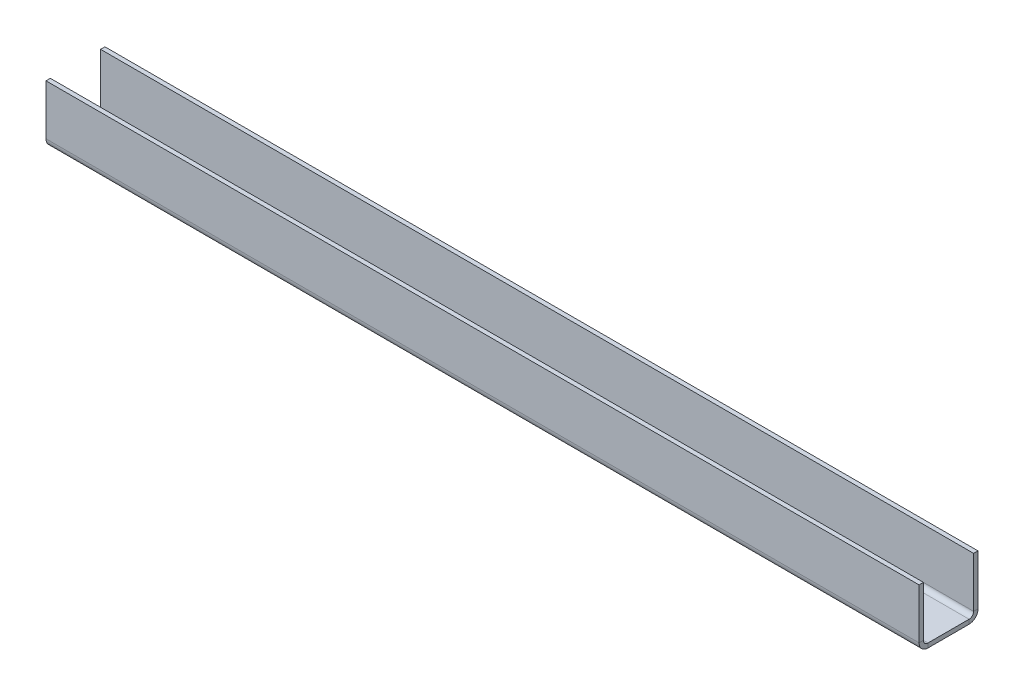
ISO-10303-21;
HEADER;
FILE_DESCRIPTION(('STEP AP214'),'2;1');
FILE_NAME('part.step','',(''),(''),'','','');
FILE_SCHEMA(('AUTOMOTIVE_DESIGN { 1 0 10303 214 1 1 1 1 }'));
ENDSEC;
DATA;
#1=APPLICATION_CONTEXT('core data for automotive mechanical design processes');
#2=APPLICATION_PROTOCOL_DEFINITION('international standard','automotive_design',2000,#1);
#3=PRODUCT_CONTEXT('',#1,'mechanical');
#4=PRODUCT('Part','Part','',(#3));
#5=PRODUCT_RELATED_PRODUCT_CATEGORY('part','',(#4));
#6=PRODUCT_DEFINITION_FORMATION('','',#4);
#7=PRODUCT_DEFINITION_CONTEXT('part definition',#1,'design');
#8=PRODUCT_DEFINITION('design','',#6,#7);
#9=PRODUCT_DEFINITION_SHAPE('','',#8);
#10=(LENGTH_UNIT() NAMED_UNIT(*) SI_UNIT(.MILLI.,.METRE.));
#11=(NAMED_UNIT(*) PLANE_ANGLE_UNIT() SI_UNIT($,.RADIAN.));
#12=(NAMED_UNIT(*) SI_UNIT($,.STERADIAN.) SOLID_ANGLE_UNIT());
#13=UNCERTAINTY_MEASURE_WITH_UNIT(LENGTH_MEASURE(1.E-05),#10,'distance_accuracy_value','');
#14=(GEOMETRIC_REPRESENTATION_CONTEXT(3) GLOBAL_UNCERTAINTY_ASSIGNED_CONTEXT((#13)) GLOBAL_UNIT_ASSIGNED_CONTEXT((#10,
#11,#12)) REPRESENTATION_CONTEXT('',''));
#15=CARTESIAN_POINT('',(0.,0.,0.));
#16=DIRECTION('',(0.,0.,1.));
#17=DIRECTION('',(1.,0.,0.));
#18=AXIS2_PLACEMENT_3D('',#15,#16,#17);
#19=CARTESIAN_POINT('',(665.771484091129,3.048,0.));
#20=DIRECTION('',(0.,-1.,0.));
#21=DIRECTION('',(0.,0.,-1.));
#22=AXIS2_PLACEMENT_3D('',#19,#20,#21);
#23=PLANE('',#22);
#24=DIRECTION('',(1.,0.,0.));
#25=VECTOR('',#24,1.);
#26=CARTESIAN_POINT('',(609.6,3.04799999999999,34.925));
#27=LINE('',#26,#25);
#28=CARTESIAN_POINT('',(609.6,3.04799999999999,34.925));
#29=VERTEX_POINT('',#28);
#30=CARTESIAN_POINT('',(0.,3.04799999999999,34.925));
#31=VERTEX_POINT('',#30);
#32=EDGE_CURVE('E210',#29,#31,#27,.F.);
#33=ORIENTED_EDGE('',*,*,#32,.F.);
#34=DIRECTION('',(0.,0.,-1.));
#35=VECTOR('',#34,1.);
#36=CARTESIAN_POINT('',(609.6,3.048,0.));
#37=LINE('',#36,#35);
#38=CARTESIAN_POINT('',(609.6,3.048,6.223));
#39=VERTEX_POINT('',#38);
#40=EDGE_CURVE('E229',#39,#29,#37,.F.);
#41=ORIENTED_EDGE('',*,*,#40,.F.);
#42=DIRECTION('',(-1.,0.,0.));
#43=VECTOR('',#42,1.);
#44=CARTESIAN_POINT('',(665.771484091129,3.048,6.223));
#45=LINE('',#44,#43);
#46=CARTESIAN_POINT('',(0.,3.048,6.223));
#47=VERTEX_POINT('',#46);
#48=EDGE_CURVE('E279',#39,#47,#45,.T.);
#49=ORIENTED_EDGE('',*,*,#48,.T.);
#50=DIRECTION('',(0.,0.,1.));
#51=VECTOR('',#50,1.);
#52=CARTESIAN_POINT('',(0.,3.048,0.));
#53=LINE('',#52,#51);
#54=EDGE_CURVE('E249',#47,#31,#53,.T.);
#55=ORIENTED_EDGE('',*,*,#54,.T.);
#56=EDGE_LOOP('',(#33,#41,#49,#55));
#57=FACE_BOUND('',#56,.T.);
#58=ADVANCED_FACE('F48',(#57),#23,.F.);
#59=CARTESIAN_POINT('',(665.771484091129,0.,0.));
#60=DIRECTION('',(0.,-1.,0.));
#61=DIRECTION('',(0.,0.,-1.));
#62=AXIS2_PLACEMENT_3D('',#59,#60,#61);
#63=PLANE('',#62);
#64=DIRECTION('',(0.,0.,1.));
#65=VECTOR('',#64,1.);
#66=CARTESIAN_POINT('',(609.6,0.,0.));
#67=LINE('',#66,#65);
#68=CARTESIAN_POINT('',(609.6,0.,6.223));
#69=VERTEX_POINT('',#68);
#70=CARTESIAN_POINT('',(609.6,0.,34.925));
#71=VERTEX_POINT('',#70);
#72=EDGE_CURVE('E228',#69,#71,#67,.T.);
#73=ORIENTED_EDGE('',*,*,#72,.T.);
#74=DIRECTION('',(1.,0.,0.));
#75=VECTOR('',#74,1.);
#76=CARTESIAN_POINT('',(609.6,0.,34.925));
#77=LINE('',#76,#75);
#78=CARTESIAN_POINT('',(0.,0.,34.925));
#79=VERTEX_POINT('',#78);
#80=EDGE_CURVE('E144',#71,#79,#77,.F.);
#81=ORIENTED_EDGE('',*,*,#80,.T.);
#82=DIRECTION('',(0.,0.,1.));
#83=VECTOR('',#82,1.);
#84=CARTESIAN_POINT('',(0.,0.,0.));
#85=LINE('',#84,#83);
#86=CARTESIAN_POINT('',(0.,0.,6.223));
#87=VERTEX_POINT('',#86);
#88=EDGE_CURVE('E256',#87,#79,#85,.T.);
#89=ORIENTED_EDGE('',*,*,#88,.F.);
#90=DIRECTION('',(-1.,0.,0.));
#91=VECTOR('',#90,1.);
#92=CARTESIAN_POINT('',(665.771484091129,0.,6.223));
#93=LINE('',#92,#91);
#94=EDGE_CURVE('E296',#69,#87,#93,.T.);
#95=ORIENTED_EDGE('',*,*,#94,.F.);
#96=EDGE_LOOP('',(#73,#81,#89,#95));
#97=FACE_BOUND('',#96,.T.);
#98=ADVANCED_FACE('F313',(#97),#63,.T.);
#99=CARTESIAN_POINT('',(0.,6.223,6.223));
#100=DIRECTION('',(1.,0.,0.));
#101=DIRECTION('',(0.,0.,-1.));
#102=AXIS2_PLACEMENT_3D('',#99,#100,#101);
#103=PLANE('',#102);
#104=DIRECTION('',(0.,-1.,0.));
#105=VECTOR('',#104,1.);
#106=CARTESIAN_POINT('',(0.,3.04799999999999,34.925));
#107=LINE('',#106,#105);
#108=EDGE_CURVE('E215',#31,#79,#107,.T.);
#109=ORIENTED_EDGE('',*,*,#108,.F.);
#110=ORIENTED_EDGE('',*,*,#54,.F.);
#111=DIRECTION('',(0.,-1.,0.));
#112=VECTOR('',#111,1.);
#113=CARTESIAN_POINT('',(0.,3.048,6.223));
#114=LINE('',#113,#112);
#115=EDGE_CURVE('E57',#47,#87,#114,.T.);
#116=ORIENTED_EDGE('',*,*,#115,.T.);
#117=ORIENTED_EDGE('',*,*,#88,.T.);
#118=EDGE_LOOP('',(#109,#110,#116,#117));
#119=FACE_BOUND('',#118,.T.);
#120=ADVANCED_FACE('F304',(#119),#103,.F.);
#121=CARTESIAN_POINT('',(609.6,0.,0.));
#122=DIRECTION('',(1.,0.,0.));
#123=DIRECTION('',(0.,0.,1.));
#124=AXIS2_PLACEMENT_3D('',#121,#122,#123);
#125=PLANE('',#124);
#126=ORIENTED_EDGE('',*,*,#40,.T.);
#127=DIRECTION('',(0.,-1.,0.));
#128=VECTOR('',#127,1.);
#129=CARTESIAN_POINT('',(609.6,3.04799999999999,34.925));
#130=LINE('',#129,#128);
#131=EDGE_CURVE('E205',#29,#71,#130,.T.);
#132=ORIENTED_EDGE('',*,*,#131,.T.);
#133=ORIENTED_EDGE('',*,*,#72,.F.);
#134=DIRECTION('',(0.,-1.,0.));
#135=VECTOR('',#134,1.);
#136=CARTESIAN_POINT('',(609.6,0.,6.223));
#137=LINE('',#136,#135);
#138=EDGE_CURVE('E233',#69,#39,#137,.F.);
#139=ORIENTED_EDGE('',*,*,#138,.T.);
#140=EDGE_LOOP('',(#126,#132,#133,#139));
#141=FACE_BOUND('',#140,.T.);
#142=ADVANCED_FACE('F335',(#141),#125,.T.);
#143=CARTESIAN_POINT('',(0.,6.223,0.));
#144=DIRECTION('',(-1.,0.,0.));
#145=DIRECTION('',(0.,0.,1.));
#146=AXIS2_PLACEMENT_3D('',#143,#144,#145);
#147=PLANE('',#146);
#148=DIRECTION('',(0.,0.,1.));
#149=VECTOR('',#148,1.);
#150=CARTESIAN_POINT('',(0.,6.223,0.));
#151=LINE('',#150,#149);
#152=CARTESIAN_POINT('',(0.,6.223,0.));
#153=VERTEX_POINT('',#152);
#154=CARTESIAN_POINT('',(0.,6.223,3.048));
#155=VERTEX_POINT('',#154);
#156=EDGE_CURVE('E11',#153,#155,#151,.T.);
#157=ORIENTED_EDGE('',*,*,#156,.F.);
#158=CARTESIAN_POINT('',(0.,6.223,6.223));
#159=DIRECTION('',(1.,0.,0.));
#160=DIRECTION('',(0.,0.,-1.));
#161=AXIS2_PLACEMENT_3D('',#158,#159,#160);
#162=CIRCLE('',#161,6.223);
#163=EDGE_CURVE('E260',#153,#87,#162,.F.);
#164=ORIENTED_EDGE('',*,*,#163,.T.);
#165=ORIENTED_EDGE('',*,*,#115,.F.);
#166=CARTESIAN_POINT('',(0.,6.223,6.223));
#167=DIRECTION('',(1.,0.,0.));
#168=DIRECTION('',(0.,0.,-1.));
#169=AXIS2_PLACEMENT_3D('',#166,#167,#168);
#170=CIRCLE('',#169,3.175);
#171=EDGE_CURVE('E275',#155,#47,#170,.F.);
#172=ORIENTED_EDGE('',*,*,#171,.F.);
#173=EDGE_LOOP('',(#157,#164,#165,#172));
#174=FACE_BOUND('',#173,.T.);
#175=ADVANCED_FACE('F50',(#174),#147,.T.);
#176=CARTESIAN_POINT('',(0.,3.048,6.223));
#177=DIRECTION('',(-1.,0.,0.));
#178=DIRECTION('',(0.,0.,1.));
#179=AXIS2_PLACEMENT_3D('',#176,#177,#178);
#180=PLANE('',#179);
#181=DIRECTION('',(0.,-1.,0.));
#182=VECTOR('',#181,1.);
#183=CARTESIAN_POINT('',(0.,0.,0.));
#184=LINE('',#183,#182);
#185=CARTESIAN_POINT('',(0.,41.275,0.));
#186=VERTEX_POINT('',#185);
#187=EDGE_CURVE('E263',#186,#153,#184,.T.);
#188=ORIENTED_EDGE('',*,*,#187,.T.);
#189=ORIENTED_EDGE('',*,*,#156,.T.);
#190=DIRECTION('',(0.,1.,0.));
#191=VECTOR('',#190,1.);
#192=CARTESIAN_POINT('',(0.,0.,3.048));
#193=LINE('',#192,#191);
#194=CARTESIAN_POINT('',(0.,41.275,3.048));
#195=VERTEX_POINT('',#194);
#196=EDGE_CURVE('E271',#195,#155,#193,.F.);
#197=ORIENTED_EDGE('',*,*,#196,.F.);
#198=DIRECTION('',(0.,0.,-1.));
#199=VECTOR('',#198,1.);
#200=CARTESIAN_POINT('',(0.,41.275,3.048));
#201=LINE('',#200,#199);
#202=EDGE_CURVE('E267',#195,#186,#201,.T.);
#203=ORIENTED_EDGE('',*,*,#202,.T.);
#204=EDGE_LOOP('',(#188,#189,#197,#203));
#205=FACE_BOUND('',#204,.T.);
#206=ADVANCED_FACE('F328',(#205),#180,.T.);
#207=CARTESIAN_POINT('',(665.771484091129,6.223,6.223));
#208=DIRECTION('',(-1.,0.,0.));
#209=DIRECTION('',(0.,0.,1.));
#210=AXIS2_PLACEMENT_3D('',#207,#208,#209);
#211=CYLINDRICAL_SURFACE('',#210,6.223);
#212=DIRECTION('',(-1.,0.,0.));
#213=VECTOR('',#212,1.);
#214=CARTESIAN_POINT('',(665.771484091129,6.223,0.));
#215=LINE('',#214,#213);
#216=CARTESIAN_POINT('',(609.6,6.223,0.));
#217=VERTEX_POINT('',#216);
#218=EDGE_CURVE('E292',#217,#153,#215,.T.);
#219=ORIENTED_EDGE('',*,*,#218,.F.);
#220=CARTESIAN_POINT('',(609.6,6.223,6.223));
#221=DIRECTION('',(-1.,0.,0.));
#222=DIRECTION('',(0.,0.,1.));
#223=AXIS2_PLACEMENT_3D('',#220,#221,#222);
#224=CIRCLE('',#223,6.223);
#225=EDGE_CURVE('E225',#69,#217,#224,.F.);
#226=ORIENTED_EDGE('',*,*,#225,.F.);
#227=ORIENTED_EDGE('',*,*,#94,.T.);
#228=ORIENTED_EDGE('',*,*,#163,.F.);
#229=EDGE_LOOP('',(#219,#226,#227,#228));
#230=FACE_BOUND('',#229,.T.);
#231=ADVANCED_FACE('F311',(#230),#211,.T.);
#232=CARTESIAN_POINT('',(665.771484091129,0.,0.));
#233=DIRECTION('',(0.,0.,-1.));
#234=DIRECTION('',(-1.,0.,0.));
#235=AXIS2_PLACEMENT_3D('',#232,#233,#234);
#236=PLANE('',#235);
#237=DIRECTION('',(-1.,0.,0.));
#238=VECTOR('',#237,1.);
#239=CARTESIAN_POINT('',(665.771484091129,41.275,0.));
#240=LINE('',#239,#238);
#241=CARTESIAN_POINT('',(609.6,41.275,0.));
#242=VERTEX_POINT('',#241);
#243=EDGE_CURVE('E289',#242,#186,#240,.T.);
#244=ORIENTED_EDGE('',*,*,#243,.F.);
#245=DIRECTION('',(0.,1.,0.));
#246=VECTOR('',#245,1.);
#247=CARTESIAN_POINT('',(609.6,0.,0.));
#248=LINE('',#247,#246);
#249=EDGE_CURVE('E239',#242,#217,#248,.F.);
#250=ORIENTED_EDGE('',*,*,#249,.T.);
#251=ORIENTED_EDGE('',*,*,#218,.T.);
#252=ORIENTED_EDGE('',*,*,#187,.F.);
#253=EDGE_LOOP('',(#244,#250,#251,#252));
#254=FACE_BOUND('',#253,.T.);
#255=ADVANCED_FACE('F319',(#254),#236,.T.);
#256=CARTESIAN_POINT('',(665.771484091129,41.275,3.048));
#257=DIRECTION('',(0.,1.,0.));
#258=DIRECTION('',(0.,0.,1.));
#259=AXIS2_PLACEMENT_3D('',#256,#257,#258);
#260=PLANE('',#259);
#261=DIRECTION('',(-1.,0.,0.));
#262=VECTOR('',#261,1.);
#263=CARTESIAN_POINT('',(665.771484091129,41.275,3.048));
#264=LINE('',#263,#262);
#265=CARTESIAN_POINT('',(609.6,41.275,3.048));
#266=VERTEX_POINT('',#265);
#267=EDGE_CURVE('E286',#266,#195,#264,.T.);
#268=ORIENTED_EDGE('',*,*,#267,.F.);
#269=DIRECTION('',(0.,0.,1.));
#270=VECTOR('',#269,1.);
#271=CARTESIAN_POINT('',(609.6,41.275,3.048));
#272=LINE('',#271,#270);
#273=EDGE_CURVE('E243',#266,#242,#272,.F.);
#274=ORIENTED_EDGE('',*,*,#273,.T.);
#275=ORIENTED_EDGE('',*,*,#243,.T.);
#276=ORIENTED_EDGE('',*,*,#202,.F.);
#277=EDGE_LOOP('',(#268,#274,#275,#276));
#278=FACE_BOUND('',#277,.T.);
#279=ADVANCED_FACE('F323',(#278),#260,.T.);
#280=CARTESIAN_POINT('',(665.771484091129,0.,3.048));
#281=DIRECTION('',(0.,0.,-1.));
#282=DIRECTION('',(-1.,0.,0.));
#283=AXIS2_PLACEMENT_3D('',#280,#281,#282);
#284=PLANE('',#283);
#285=DIRECTION('',(0.,-1.,0.));
#286=VECTOR('',#285,1.);
#287=CARTESIAN_POINT('',(609.6,0.,3.048));
#288=LINE('',#287,#286);
#289=CARTESIAN_POINT('',(609.6,6.223,3.048));
#290=VERTEX_POINT('',#289);
#291=EDGE_CURVE('E64',#266,#290,#288,.T.);
#292=ORIENTED_EDGE('',*,*,#291,.F.);
#293=ORIENTED_EDGE('',*,*,#267,.T.);
#294=ORIENTED_EDGE('',*,*,#196,.T.);
#295=DIRECTION('',(-1.,0.,0.));
#296=VECTOR('',#295,1.);
#297=CARTESIAN_POINT('',(665.771484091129,6.223,3.048));
#298=LINE('',#297,#296);
#299=EDGE_CURVE('E282',#290,#155,#298,.T.);
#300=ORIENTED_EDGE('',*,*,#299,.F.);
#301=EDGE_LOOP('',(#292,#293,#294,#300));
#302=FACE_BOUND('',#301,.T.);
#303=ADVANCED_FACE('F326',(#302),#284,.F.);
#304=CARTESIAN_POINT('',(665.771484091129,6.223,6.223));
#305=DIRECTION('',(-1.,0.,0.));
#306=DIRECTION('',(0.,0.,1.));
#307=AXIS2_PLACEMENT_3D('',#304,#305,#306);
#308=CYLINDRICAL_SURFACE('',#307,3.175);
#309=CARTESIAN_POINT('',(609.6,6.223,6.223));
#310=DIRECTION('',(1.,0.,0.));
#311=DIRECTION('',(0.,0.,-1.));
#312=AXIS2_PLACEMENT_3D('',#309,#310,#311);
#313=CIRCLE('',#312,3.175);
#314=EDGE_CURVE('E219',#290,#39,#313,.F.);
#315=ORIENTED_EDGE('',*,*,#314,.F.);
#316=ORIENTED_EDGE('',*,*,#299,.T.);
#317=ORIENTED_EDGE('',*,*,#171,.T.);
#318=ORIENTED_EDGE('',*,*,#48,.F.);
#319=EDGE_LOOP('',(#315,#316,#317,#318));
#320=FACE_BOUND('',#319,.T.);
#321=ADVANCED_FACE('F352',(#320),#308,.F.);
#322=CARTESIAN_POINT('',(609.6,0.,3.048));
#323=DIRECTION('',(1.,0.,0.));
#324=DIRECTION('',(0.,-1.,0.));
#325=AXIS2_PLACEMENT_3D('',#322,#323,#324);
#326=PLANE('',#325);
#327=ORIENTED_EDGE('',*,*,#291,.T.);
#328=DIRECTION('',(0.,0.,1.));
#329=VECTOR('',#328,1.);
#330=CARTESIAN_POINT('',(609.6,6.223,3.048));
#331=LINE('',#330,#329);
#332=EDGE_CURVE('E246',#290,#217,#331,.F.);
#333=ORIENTED_EDGE('',*,*,#332,.T.);
#334=ORIENTED_EDGE('',*,*,#249,.F.);
#335=ORIENTED_EDGE('',*,*,#273,.F.);
#336=EDGE_LOOP('',(#327,#333,#334,#335));
#337=FACE_BOUND('',#336,.T.);
#338=ADVANCED_FACE('F320',(#337),#326,.T.);
#339=CARTESIAN_POINT('',(609.6,6.223,6.223));
#340=DIRECTION('',(-1.,0.,0.));
#341=DIRECTION('',(0.,0.,1.));
#342=AXIS2_PLACEMENT_3D('',#339,#340,#341);
#343=PLANE('',#342);
#344=ORIENTED_EDGE('',*,*,#225,.T.);
#345=ORIENTED_EDGE('',*,*,#332,.F.);
#346=ORIENTED_EDGE('',*,*,#314,.T.);
#347=ORIENTED_EDGE('',*,*,#138,.F.);
#348=EDGE_LOOP('',(#344,#345,#346,#347));
#349=FACE_BOUND('',#348,.T.);
#350=ADVANCED_FACE('F360',(#349),#343,.F.);
#351=CARTESIAN_POINT('',(0.,6.22299999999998,34.925));
#352=DIRECTION('',(-1.,0.,0.));
#353=DIRECTION('',(0.,0.,1.));
#354=AXIS2_PLACEMENT_3D('',#351,#352,#353);
#355=PLANE('',#354);
#356=DIRECTION('',(0.,0.,1.));
#357=VECTOR('',#356,1.);
#358=CARTESIAN_POINT('',(0.,6.22299999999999,38.1));
#359=LINE('',#358,#357);
#360=CARTESIAN_POINT('',(0.,6.22299999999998,38.1));
#361=VERTEX_POINT('',#360);
#362=CARTESIAN_POINT('',(0.,6.22299999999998,41.148));
#363=VERTEX_POINT('',#362);
#364=EDGE_CURVE('E570',#361,#363,#359,.T.);
#365=ORIENTED_EDGE('',*,*,#364,.F.);
#366=CARTESIAN_POINT('',(0.,6.22299999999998,34.925));
#367=DIRECTION('',(1.,0.,0.));
#368=DIRECTION('',(0.,0.,-1.));
#369=AXIS2_PLACEMENT_3D('',#366,#367,#368);
#370=CIRCLE('',#369,3.17499999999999);
#371=EDGE_CURVE('E148',#31,#361,#370,.F.);
#372=ORIENTED_EDGE('',*,*,#371,.F.);
#373=ORIENTED_EDGE('',*,*,#108,.T.);
#374=CARTESIAN_POINT('',(0.,6.22299999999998,34.925));
#375=DIRECTION('',(1.,0.,0.));
#376=DIRECTION('',(0.,0.,-1.));
#377=AXIS2_PLACEMENT_3D('',#374,#375,#376);
#378=CIRCLE('',#377,6.22299999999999);
#379=EDGE_CURVE('E203',#79,#363,#378,.F.);
#380=ORIENTED_EDGE('',*,*,#379,.T.);
#381=EDGE_LOOP('',(#365,#372,#373,#380));
#382=FACE_BOUND('',#381,.T.);
#383=ADVANCED_FACE('F365',(#382),#355,.T.);
#384=CARTESIAN_POINT('',(609.6,6.22299999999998,34.925));
#385=DIRECTION('',(-1.,0.,0.));
#386=DIRECTION('',(0.,0.,1.));
#387=AXIS2_PLACEMENT_3D('',#384,#385,#386);
#388=PLANE('',#387);
#389=CARTESIAN_POINT('',(609.6,6.22299999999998,34.925));
#390=DIRECTION('',(1.,0.,0.));
#391=DIRECTION('',(0.,0.,-1.));
#392=AXIS2_PLACEMENT_3D('',#389,#390,#391);
#393=CIRCLE('',#392,3.17499999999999);
#394=CARTESIAN_POINT('',(609.6,6.22299999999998,38.1));
#395=VERTEX_POINT('',#394);
#396=EDGE_CURVE('E155',#395,#29,#393,.T.);
#397=ORIENTED_EDGE('',*,*,#396,.F.);
#398=DIRECTION('',(0.,0.,1.));
#399=VECTOR('',#398,1.);
#400=CARTESIAN_POINT('',(609.6,6.22299999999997,38.1));
#401=LINE('',#400,#399);
#402=CARTESIAN_POINT('',(609.6,6.22299999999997,41.148));
#403=VERTEX_POINT('',#402);
#404=EDGE_CURVE('E152',#395,#403,#401,.T.);
#405=ORIENTED_EDGE('',*,*,#404,.T.);
#406=CARTESIAN_POINT('',(609.6,6.22299999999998,34.925));
#407=DIRECTION('',(1.,0.,0.));
#408=DIRECTION('',(0.,0.,-1.));
#409=AXIS2_PLACEMENT_3D('',#406,#407,#408);
#410=CIRCLE('',#409,6.22299999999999);
#411=EDGE_CURVE('E137',#403,#71,#410,.T.);
#412=ORIENTED_EDGE('',*,*,#411,.T.);
#413=ORIENTED_EDGE('',*,*,#131,.F.);
#414=EDGE_LOOP('',(#397,#405,#412,#413));
#415=FACE_BOUND('',#414,.T.);
#416=ADVANCED_FACE('F153',(#415),#388,.F.);
#417=CARTESIAN_POINT('',(609.6,6.22299999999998,34.925));
#418=DIRECTION('',(1.,0.,0.));
#419=DIRECTION('',(0.,0.,1.));
#420=AXIS2_PLACEMENT_3D('',#417,#418,#419);
#421=CYLINDRICAL_SURFACE('',#420,6.22299999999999);
#422=ORIENTED_EDGE('',*,*,#80,.F.);
#423=ORIENTED_EDGE('',*,*,#411,.F.);
#424=DIRECTION('',(-1.,0.,0.));
#425=VECTOR('',#424,1.);
#426=CARTESIAN_POINT('',(0.,6.22299999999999,41.148));
#427=LINE('',#426,#425);
#428=EDGE_CURVE('E141',#403,#363,#427,.T.);
#429=ORIENTED_EDGE('',*,*,#428,.T.);
#430=ORIENTED_EDGE('',*,*,#379,.F.);
#431=EDGE_LOOP('',(#422,#423,#429,#430));
#432=FACE_BOUND('',#431,.T.);
#433=ADVANCED_FACE('F139',(#432),#421,.T.);
#434=CARTESIAN_POINT('',(609.6,6.22299999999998,34.925));
#435=DIRECTION('',(1.,0.,0.));
#436=DIRECTION('',(0.,0.,1.));
#437=AXIS2_PLACEMENT_3D('',#434,#435,#436);
#438=CYLINDRICAL_SURFACE('',#437,3.17499999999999);
#439=ORIENTED_EDGE('',*,*,#32,.T.);
#440=ORIENTED_EDGE('',*,*,#371,.T.);
#441=DIRECTION('',(1.,0.,0.));
#442=VECTOR('',#441,1.);
#443=CARTESIAN_POINT('',(0.,6.22299999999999,38.1));
#444=LINE('',#443,#442);
#445=EDGE_CURVE('E160',#361,#395,#444,.T.);
#446=ORIENTED_EDGE('',*,*,#445,.T.);
#447=ORIENTED_EDGE('',*,*,#396,.T.);
#448=EDGE_LOOP('',(#439,#440,#446,#447));
#449=FACE_BOUND('',#448,.T.);
#450=ADVANCED_FACE('F372',(#449),#438,.F.);
#451=CARTESIAN_POINT('',(609.6,41.275,41.148));
#452=DIRECTION('',(-1.,0.,0.));
#453=DIRECTION('',(0.,0.,1.));
#454=AXIS2_PLACEMENT_3D('',#451,#452,#453);
#455=PLANE('',#454);
#456=ORIENTED_EDGE('',*,*,#404,.F.);
#457=DIRECTION('',(0.,1.,0.));
#458=VECTOR('',#457,1.);
#459=CARTESIAN_POINT('',(609.6,41.275,38.1));
#460=LINE('',#459,#458);
#461=CARTESIAN_POINT('',(609.6,41.275,38.1));
#462=VERTEX_POINT('',#461);
#463=EDGE_CURVE('E170',#395,#462,#460,.T.);
#464=ORIENTED_EDGE('',*,*,#463,.T.);
#465=DIRECTION('',(0.,0.,-1.));
#466=VECTOR('',#465,1.);
#467=CARTESIAN_POINT('',(609.6,41.275,41.148));
#468=LINE('',#467,#466);
#469=CARTESIAN_POINT('',(609.6,41.275,41.148));
#470=VERTEX_POINT('',#469);
#471=EDGE_CURVE('E175',#470,#462,#468,.T.);
#472=ORIENTED_EDGE('',*,*,#471,.F.);
#473=DIRECTION('',(0.,1.,0.));
#474=VECTOR('',#473,1.);
#475=CARTESIAN_POINT('',(609.6,41.275,41.148));
#476=LINE('',#475,#474);
#477=EDGE_CURVE('E165',#403,#470,#476,.T.);
#478=ORIENTED_EDGE('',*,*,#477,.F.);
#479=EDGE_LOOP('',(#456,#464,#472,#478));
#480=FACE_BOUND('',#479,.T.);
#481=ADVANCED_FACE('F173',(#480),#455,.F.);
#482=CARTESIAN_POINT('',(0.,3.04799999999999,41.148));
#483=DIRECTION('',(1.,0.,0.));
#484=DIRECTION('',(0.,0.,-1.));
#485=AXIS2_PLACEMENT_3D('',#482,#483,#484);
#486=PLANE('',#485);
#487=ORIENTED_EDGE('',*,*,#364,.T.);
#488=DIRECTION('',(0.,-1.,0.));
#489=VECTOR('',#488,1.);
#490=CARTESIAN_POINT('',(0.,3.04799999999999,41.148));
#491=LINE('',#490,#489);
#492=CARTESIAN_POINT('',(0.,41.275,41.148));
#493=VERTEX_POINT('',#492);
#494=EDGE_CURVE('E168',#493,#363,#491,.T.);
#495=ORIENTED_EDGE('',*,*,#494,.F.);
#496=DIRECTION('',(0.,0.,-1.));
#497=VECTOR('',#496,1.);
#498=CARTESIAN_POINT('',(0.,41.275,41.148));
#499=LINE('',#498,#497);
#500=CARTESIAN_POINT('',(0.,41.275,38.1));
#501=VERTEX_POINT('',#500);
#502=EDGE_CURVE('E191',#493,#501,#499,.T.);
#503=ORIENTED_EDGE('',*,*,#502,.T.);
#504=DIRECTION('',(0.,-1.,0.));
#505=VECTOR('',#504,1.);
#506=CARTESIAN_POINT('',(0.,3.04799999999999,38.1));
#507=LINE('',#506,#505);
#508=EDGE_CURVE('E178',#501,#361,#507,.T.);
#509=ORIENTED_EDGE('',*,*,#508,.T.);
#510=EDGE_LOOP('',(#487,#495,#503,#509));
#511=FACE_BOUND('',#510,.T.);
#512=ADVANCED_FACE('F380',(#511),#486,.F.);
#513=CARTESIAN_POINT('',(0.,0.,41.148));
#514=DIRECTION('',(0.,0.,-1.));
#515=DIRECTION('',(-1.,0.,0.));
#516=AXIS2_PLACEMENT_3D('',#513,#514,#515);
#517=PLANE('',#516);
#518=ORIENTED_EDGE('',*,*,#428,.F.);
#519=ORIENTED_EDGE('',*,*,#477,.T.);
#520=DIRECTION('',(-1.,0.,0.));
#521=VECTOR('',#520,1.);
#522=CARTESIAN_POINT('',(0.,41.275,41.148));
#523=LINE('',#522,#521);
#524=EDGE_CURVE('E177',#470,#493,#523,.T.);
#525=ORIENTED_EDGE('',*,*,#524,.T.);
#526=ORIENTED_EDGE('',*,*,#494,.T.);
#527=EDGE_LOOP('',(#518,#519,#525,#526));
#528=FACE_BOUND('',#527,.T.);
#529=ADVANCED_FACE('F164',(#528),#517,.F.);
#530=CARTESIAN_POINT('',(0.,0.,38.1));
#531=DIRECTION('',(0.,0.,-1.));
#532=DIRECTION('',(-1.,0.,0.));
#533=AXIS2_PLACEMENT_3D('',#530,#531,#532);
#534=PLANE('',#533);
#535=ORIENTED_EDGE('',*,*,#463,.F.);
#536=ORIENTED_EDGE('',*,*,#445,.F.);
#537=ORIENTED_EDGE('',*,*,#508,.F.);
#538=DIRECTION('',(-1.,0.,0.));
#539=VECTOR('',#538,1.);
#540=CARTESIAN_POINT('',(0.,41.275,38.1));
#541=LINE('',#540,#539);
#542=EDGE_CURVE('E185',#462,#501,#541,.T.);
#543=ORIENTED_EDGE('',*,*,#542,.F.);
#544=EDGE_LOOP('',(#535,#536,#537,#543));
#545=FACE_BOUND('',#544,.T.);
#546=ADVANCED_FACE('F384',(#545),#534,.T.);
#547=CARTESIAN_POINT('',(0.,41.275,41.148));
#548=DIRECTION('',(0.,-1.,0.));
#549=DIRECTION('',(0.,0.,-1.));
#550=AXIS2_PLACEMENT_3D('',#547,#548,#549);
#551=PLANE('',#550);
#552=ORIENTED_EDGE('',*,*,#542,.T.);
#553=ORIENTED_EDGE('',*,*,#502,.F.);
#554=ORIENTED_EDGE('',*,*,#524,.F.);
#555=ORIENTED_EDGE('',*,*,#471,.T.);
#556=EDGE_LOOP('',(#552,#553,#554,#555));
#557=FACE_BOUND('',#556,.T.);
#558=ADVANCED_FACE('F381',(#557),#551,.F.);
#559=CLOSED_SHELL('',(#58,#98,#120,#142,#175,#206,#231,#255,#279,#303,#321,#338,#350,#383,#416,
#433,#450,#481,#512,#529,#546,#558));
#560=MANIFOLD_SOLID_BREP('B2',#559);
#561=ADVANCED_BREP_SHAPE_REPRESENTATION('',(#18,#560),#14);
#562=SHAPE_DEFINITION_REPRESENTATION(#9,#561);
ENDSEC;
END-ISO-10303-21;
